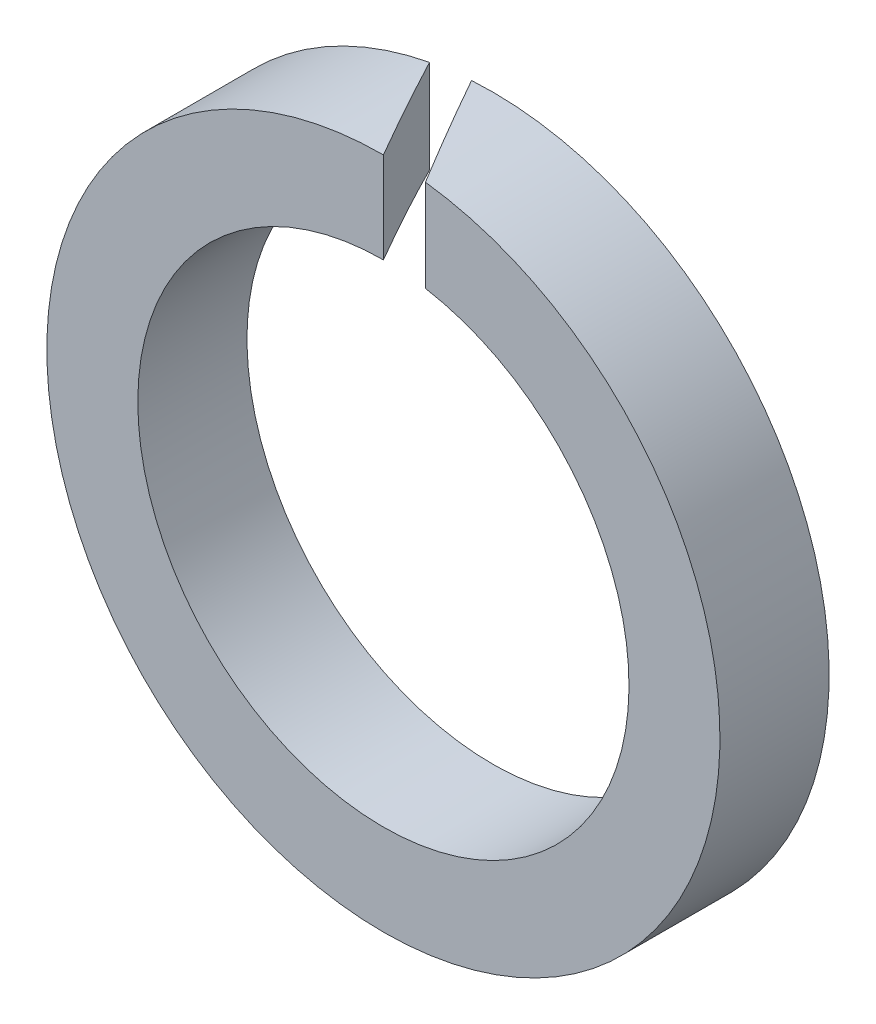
from build123d import *

# Parameters (mm, degrees)
ESQUISSE1_R             = 18.5
BASE_EXTRUSION_DEPTH    = 6
ESQUISSE2_R             = 13.5
ENL_V_MAT_EXTRU_1_DEPTH = 6
ENL_V_MAT_EXTRU_2_DEPTH = 10


with BuildPart() as part:
    # Esquisse1 → Base-Extrusion (new body)
    with BuildSketch(Plane.XY):
        Circle(ESQUISSE1_R)
    extrude(amount=-BASE_EXTRUSION_DEPTH)

    # Esquisse2 → Enl_v. mat.-Extru.1 (cut)
    with BuildSketch(Plane.XY):
        Circle(ESQUISSE2_R)
    extrude(amount=-ENL_V_MAT_EXTRU_1_DEPTH, mode=Mode.SUBTRACT)

    # Esquisse3 → Enl_v. mat.-Extru.2 (cut)
    with BuildSketch(Plane(origin=(0, 18.5, 0), x_dir=(-1, 0, 0), z_dir=(0, 1, 0))):
        Polygon((0, 0), (3.464101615, -6), (1.154700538, -6), (-2.309401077, 0), align=None)
    extrude(amount=-ENL_V_MAT_EXTRU_2_DEPTH, mode=Mode.SUBTRACT)


solid = part.part
